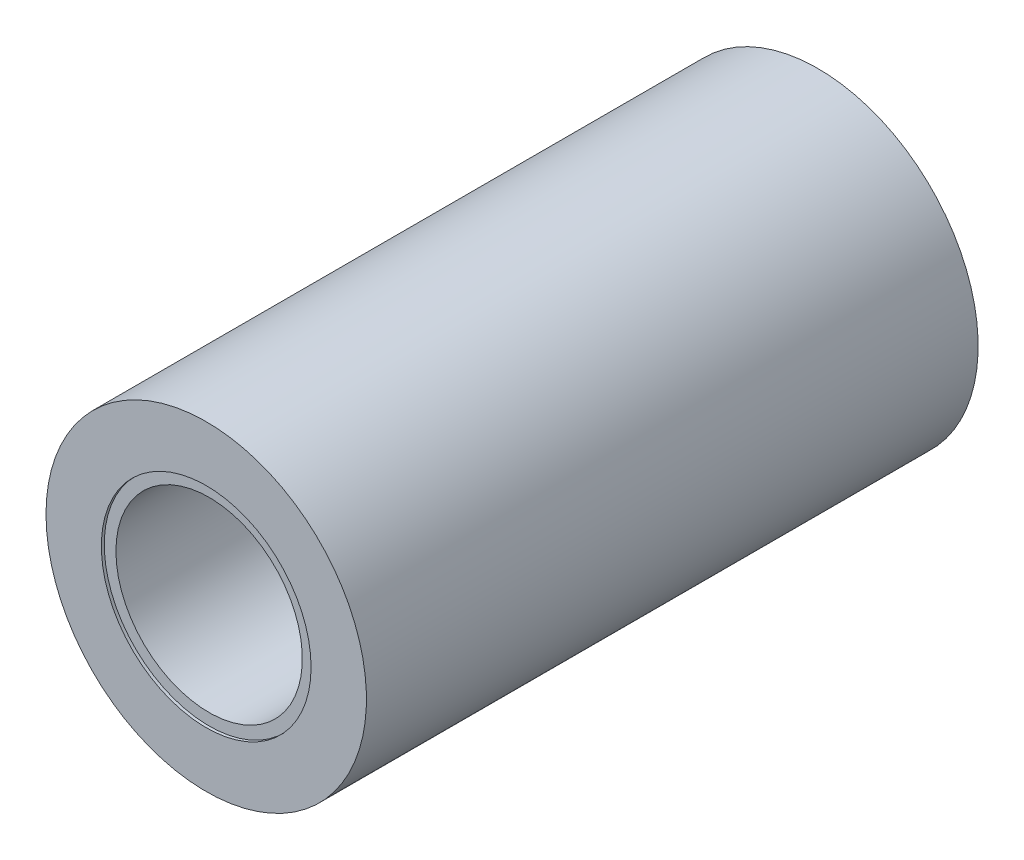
ISO-10303-21;
HEADER;
FILE_DESCRIPTION(('STEP AP214'),'2;1');
FILE_NAME('part.step','',(''),(''),'','','');
FILE_SCHEMA(('AUTOMOTIVE_DESIGN { 1 0 10303 214 1 1 1 1 }'));
ENDSEC;
DATA;
#1=APPLICATION_CONTEXT('core data for automotive mechanical design processes');
#2=APPLICATION_PROTOCOL_DEFINITION('international standard','automotive_design',2000,#1);
#3=PRODUCT_CONTEXT('',#1,'mechanical');
#4=PRODUCT('Part','Part','',(#3));
#5=PRODUCT_RELATED_PRODUCT_CATEGORY('part','',(#4));
#6=PRODUCT_DEFINITION_FORMATION('','',#4);
#7=PRODUCT_DEFINITION_CONTEXT('part definition',#1,'design');
#8=PRODUCT_DEFINITION('design','',#6,#7);
#9=PRODUCT_DEFINITION_SHAPE('','',#8);
#10=(LENGTH_UNIT() NAMED_UNIT(*) SI_UNIT(.MILLI.,.METRE.));
#11=(NAMED_UNIT(*) PLANE_ANGLE_UNIT() SI_UNIT($,.RADIAN.));
#12=(NAMED_UNIT(*) SI_UNIT($,.STERADIAN.) SOLID_ANGLE_UNIT());
#13=UNCERTAINTY_MEASURE_WITH_UNIT(LENGTH_MEASURE(1.E-05),#10,'distance_accuracy_value','');
#14=(GEOMETRIC_REPRESENTATION_CONTEXT(3) GLOBAL_UNCERTAINTY_ASSIGNED_CONTEXT((#13)) GLOBAL_UNIT_ASSIGNED_CONTEXT((#10,
#11,#12)) REPRESENTATION_CONTEXT('',''));
#15=CARTESIAN_POINT('',(0.,0.,0.));
#16=DIRECTION('',(0.,0.,1.));
#17=DIRECTION('',(1.,0.,0.));
#18=AXIS2_PLACEMENT_3D('',#15,#16,#17);
#19=CARTESIAN_POINT('',(0.,0.,10.5));
#20=DIRECTION('',(0.,0.,-1.));
#21=DIRECTION('',(-1.,0.,0.));
#22=AXIS2_PLACEMENT_3D('',#19,#20,#21);
#23=CYLINDRICAL_SURFACE('',#22,3.2);
#24=CARTESIAN_POINT('',(0.,0.,10.4));
#25=DIRECTION('',(0.,0.,1.));
#26=DIRECTION('',(1.,0.,0.));
#27=AXIS2_PLACEMENT_3D('',#24,#25,#26);
#28=CIRCLE('',#27,3.2);
#29=CARTESIAN_POINT('',(-3.2,0.,10.4));
#30=VERTEX_POINT('',#29);
#31=EDGE_CURVE('E47',#30,#30,#28,.T.);
#32=CARTESIAN_POINT('',(0.,0.,-10.4));
#33=DIRECTION('',(0.,0.,-1.));
#34=DIRECTION('',(-1.,0.,0.));
#35=AXIS2_PLACEMENT_3D('',#32,#33,#34);
#36=CIRCLE('',#35,3.2);
#37=CARTESIAN_POINT('',(-3.2,0.,-10.4));
#38=VERTEX_POINT('',#37);
#39=EDGE_CURVE('E38',#38,#38,#36,.T.);
#40=CARTESIAN_POINT('',(-3.2,0.,10.4));
#41=CARTESIAN_POINT('',(-3.2,0.,10.1833333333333));
#42=CARTESIAN_POINT('',(-3.2,0.,9.96666666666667));
#43=CARTESIAN_POINT('',(-3.2,0.,9.53333333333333));
#44=CARTESIAN_POINT('',(-3.2,0.,9.31666666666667));
#45=CARTESIAN_POINT('',(-3.2,0.,8.88333333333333));
#46=CARTESIAN_POINT('',(-3.2,0.,8.66666666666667));
#47=CARTESIAN_POINT('',(-3.2,0.,8.23333333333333));
#48=CARTESIAN_POINT('',(-3.2,0.,8.01666666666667));
#49=CARTESIAN_POINT('',(-3.2,0.,7.58333333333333));
#50=CARTESIAN_POINT('',(-3.2,0.,7.36666666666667));
#51=CARTESIAN_POINT('',(-3.2,0.,6.93333333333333));
#52=CARTESIAN_POINT('',(-3.2,0.,6.71666666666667));
#53=CARTESIAN_POINT('',(-3.2,0.,6.28333333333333));
#54=CARTESIAN_POINT('',(-3.2,0.,6.06666666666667));
#55=CARTESIAN_POINT('',(-3.2,0.,5.63333333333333));
#56=CARTESIAN_POINT('',(-3.2,0.,5.41666666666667));
#57=CARTESIAN_POINT('',(-3.2,0.,4.98333333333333));
#58=CARTESIAN_POINT('',(-3.2,0.,4.76666666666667));
#59=CARTESIAN_POINT('',(-3.2,0.,4.33333333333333));
#60=CARTESIAN_POINT('',(-3.2,0.,4.11666666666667));
#61=CARTESIAN_POINT('',(-3.2,0.,3.68333333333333));
#62=CARTESIAN_POINT('',(-3.2,0.,3.46666666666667));
#63=CARTESIAN_POINT('',(-3.2,0.,3.03333333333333));
#64=CARTESIAN_POINT('',(-3.2,0.,2.81666666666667));
#65=CARTESIAN_POINT('',(-3.2,0.,2.38333333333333));
#66=CARTESIAN_POINT('',(-3.2,0.,2.16666666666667));
#67=CARTESIAN_POINT('',(-3.2,0.,1.73333333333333));
#68=CARTESIAN_POINT('',(-3.2,0.,1.51666666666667));
#69=CARTESIAN_POINT('',(-3.2,0.,1.08333333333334));
#70=CARTESIAN_POINT('',(-3.2,0.,0.866666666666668));
#71=CARTESIAN_POINT('',(-3.2,0.,0.433333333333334));
#72=CARTESIAN_POINT('',(-3.2,0.,0.216666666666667));
#73=CARTESIAN_POINT('',(-3.2,0.,-0.216666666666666));
#74=CARTESIAN_POINT('',(-3.2,0.,-0.433333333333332));
#75=CARTESIAN_POINT('',(-3.2,0.,-0.866666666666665));
#76=CARTESIAN_POINT('',(-3.2,0.,-1.08333333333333));
#77=CARTESIAN_POINT('',(-3.2,0.,-1.51666666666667));
#78=CARTESIAN_POINT('',(-3.2,0.,-1.73333333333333));
#79=CARTESIAN_POINT('',(-3.2,0.,-2.16666666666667));
#80=CARTESIAN_POINT('',(-3.2,0.,-2.38333333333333));
#81=CARTESIAN_POINT('',(-3.2,0.,-2.81666666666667));
#82=CARTESIAN_POINT('',(-3.2,0.,-3.03333333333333));
#83=CARTESIAN_POINT('',(-3.2,0.,-3.46666666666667));
#84=CARTESIAN_POINT('',(-3.2,0.,-3.68333333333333));
#85=CARTESIAN_POINT('',(-3.2,0.,-4.11666666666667));
#86=CARTESIAN_POINT('',(-3.2,0.,-4.33333333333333));
#87=CARTESIAN_POINT('',(-3.2,0.,-4.76666666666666));
#88=CARTESIAN_POINT('',(-3.2,0.,-4.98333333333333));
#89=CARTESIAN_POINT('',(-3.2,0.,-5.41666666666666));
#90=CARTESIAN_POINT('',(-3.2,0.,-5.63333333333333));
#91=CARTESIAN_POINT('',(-3.2,0.,-6.06666666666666));
#92=CARTESIAN_POINT('',(-3.2,0.,-6.28333333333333));
#93=CARTESIAN_POINT('',(-3.2,0.,-6.71666666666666));
#94=CARTESIAN_POINT('',(-3.2,0.,-6.93333333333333));
#95=CARTESIAN_POINT('',(-3.2,0.,-7.36666666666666));
#96=CARTESIAN_POINT('',(-3.2,0.,-7.58333333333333));
#97=CARTESIAN_POINT('',(-3.2,0.,-8.01666666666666));
#98=CARTESIAN_POINT('',(-3.2,0.,-8.23333333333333));
#99=CARTESIAN_POINT('',(-3.2,0.,-8.66666666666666));
#100=CARTESIAN_POINT('',(-3.2,0.,-8.88333333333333));
#101=CARTESIAN_POINT('',(-3.2,0.,-9.31666666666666));
#102=CARTESIAN_POINT('',(-3.2,0.,-9.53333333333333));
#103=CARTESIAN_POINT('',(-3.2,0.,-9.96666666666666));
#104=CARTESIAN_POINT('',(-3.2,0.,-10.1833333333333));
#105=CARTESIAN_POINT('',(-3.2,0.,-10.4));
#106=B_SPLINE_CURVE_WITH_KNOTS('',3,(#40,#41,#42,#43,#44,#45,#46,#47,#48,#49,#50,#51,#52,#53,
#54,#55,#56,#57,#58,#59,#60,#61,#62,#63,#64,#65,#66,#67,#68,#69,#70,#71,#72,#73,#74,#75,#76,#77,
#78,#79,#80,#81,#82,#83,#84,#85,#86,#87,#88,#89,#90,#91,#92,#93,#94,#95,#96,#97,#98,#99,#100,
#101,#102,#103,#104,#105),.UNSPECIFIED.,.F.,.F.,(4,2,2,2,2,2,2,2,2,2,2,2,2,2,2,2,2,2,2,2,2,2,2,
2,2,2,2,2,2,2,2,2,4),(0.,0.650000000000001,1.3,1.95,2.6,3.25,3.9,4.55,5.2,5.85,6.5,7.15,7.8,
8.45,9.1,9.75,10.4,11.05,11.7,12.35,13.,13.65,14.3,14.95,15.6,16.25,16.9,17.55,18.2,18.85,19.5,
20.15,20.8),.UNSPECIFIED.);
#107=EDGE_CURVE('BSEAM34',#30,#38,#106,.T.);
#108=ORIENTED_EDGE('',*,*,#31,.T.);
#109=ORIENTED_EDGE('',*,*,#39,.T.);
#110=ORIENTED_EDGE('',*,*,#107,.T.);
#111=ORIENTED_EDGE('',*,*,#107,.F.);
#112=EDGE_LOOP('',(#108,#110,#109,#111));
#113=FACE_BOUND('',#112,.T.);
#114=ADVANCED_FACE('F34',(#113),#23,.F.);
#115=CARTESIAN_POINT('',(0.,0.,10.5));
#116=DIRECTION('',(0.,0.,1.));
#117=DIRECTION('',(1.,0.,0.));
#118=AXIS2_PLACEMENT_3D('',#115,#116,#117);
#119=PLANE('',#118);
#120=CARTESIAN_POINT('',(0.,0.,10.5));
#121=DIRECTION('',(0.,0.,1.));
#122=DIRECTION('',(1.,0.,0.));
#123=AXIS2_PLACEMENT_3D('',#120,#121,#122);
#124=CIRCLE('',#123,3.6);
#125=CARTESIAN_POINT('',(3.6,0.,10.5));
#126=VERTEX_POINT('',#125);
#127=EDGE_CURVE('E50',#126,#126,#124,.T.);
#128=ORIENTED_EDGE('',*,*,#127,.F.);
#129=EDGE_LOOP('',(#128));
#130=FACE_BOUND('',#129,.T.);
#131=CARTESIAN_POINT('',(0.,0.,10.5));
#132=DIRECTION('',(0.,0.,1.));
#133=DIRECTION('',(1.,0.,0.));
#134=AXIS2_PLACEMENT_3D('',#131,#132,#133);
#135=CIRCLE('',#134,5.5);
#136=CARTESIAN_POINT('',(-5.5,0.,10.5));
#137=VERTEX_POINT('',#136);
#138=EDGE_CURVE('E10',#137,#137,#135,.T.);
#139=ORIENTED_EDGE('',*,*,#138,.T.);
#140=EDGE_LOOP('',(#139));
#141=FACE_BOUND('',#140,.T.);
#142=ADVANCED_FACE('F83',(#130,#141),#119,.T.);
#143=CARTESIAN_POINT('',(0.,0.,-10.5));
#144=DIRECTION('',(0.,0.,1.));
#145=DIRECTION('',(1.,0.,0.));
#146=AXIS2_PLACEMENT_3D('',#143,#144,#145);
#147=PLANE('',#146);
#148=CARTESIAN_POINT('',(0.,0.,-10.5));
#149=DIRECTION('',(0.,0.,-1.));
#150=DIRECTION('',(-1.,0.,0.));
#151=AXIS2_PLACEMENT_3D('',#148,#149,#150);
#152=CIRCLE('',#151,3.6);
#153=CARTESIAN_POINT('',(-3.6,0.,-10.5));
#154=VERTEX_POINT('',#153);
#155=EDGE_CURVE('E61',#154,#154,#152,.T.);
#156=ORIENTED_EDGE('',*,*,#155,.F.);
#157=EDGE_LOOP('',(#156));
#158=FACE_BOUND('',#157,.T.);
#159=CARTESIAN_POINT('',(0.,0.,-10.5));
#160=DIRECTION('',(0.,0.,1.));
#161=DIRECTION('',(1.,0.,0.));
#162=AXIS2_PLACEMENT_3D('',#159,#160,#161);
#163=CIRCLE('',#162,5.5);
#164=CARTESIAN_POINT('',(-5.5,0.,-10.5));
#165=VERTEX_POINT('',#164);
#166=EDGE_CURVE('E42',#165,#165,#163,.T.);
#167=ORIENTED_EDGE('',*,*,#166,.F.);
#168=EDGE_LOOP('',(#167));
#169=FACE_BOUND('',#168,.T.);
#170=ADVANCED_FACE('F88',(#158,#169),#147,.F.);
#171=CARTESIAN_POINT('',(0.,0.,10.5));
#172=DIRECTION('',(0.,0.,-1.));
#173=DIRECTION('',(-1.,0.,0.));
#174=AXIS2_PLACEMENT_3D('',#171,#172,#173);
#175=CYLINDRICAL_SURFACE('',#174,5.5);
#176=CARTESIAN_POINT('',(-5.5,0.,10.5));
#177=CARTESIAN_POINT('',(-5.5,0.,10.28125));
#178=CARTESIAN_POINT('',(-5.5,0.,10.0625));
#179=CARTESIAN_POINT('',(-5.5,0.,9.625));
#180=CARTESIAN_POINT('',(-5.5,0.,9.40625));
#181=CARTESIAN_POINT('',(-5.5,0.,8.96875));
#182=CARTESIAN_POINT('',(-5.5,0.,8.75));
#183=CARTESIAN_POINT('',(-5.5,0.,8.3125));
#184=CARTESIAN_POINT('',(-5.5,0.,8.09375));
#185=CARTESIAN_POINT('',(-5.5,0.,7.65625));
#186=CARTESIAN_POINT('',(-5.5,0.,7.4375));
#187=CARTESIAN_POINT('',(-5.5,0.,7.));
#188=CARTESIAN_POINT('',(-5.5,0.,6.78125));
#189=CARTESIAN_POINT('',(-5.5,0.,6.34375));
#190=CARTESIAN_POINT('',(-5.5,0.,6.125));
#191=CARTESIAN_POINT('',(-5.5,0.,5.6875));
#192=CARTESIAN_POINT('',(-5.5,0.,5.46875));
#193=CARTESIAN_POINT('',(-5.5,0.,5.03125));
#194=CARTESIAN_POINT('',(-5.5,0.,4.8125));
#195=CARTESIAN_POINT('',(-5.5,0.,4.375));
#196=CARTESIAN_POINT('',(-5.5,0.,4.15625));
#197=CARTESIAN_POINT('',(-5.5,0.,3.71875));
#198=CARTESIAN_POINT('',(-5.5,0.,3.5));
#199=CARTESIAN_POINT('',(-5.5,0.,3.0625));
#200=CARTESIAN_POINT('',(-5.5,0.,2.84375));
#201=CARTESIAN_POINT('',(-5.5,0.,2.40625));
#202=CARTESIAN_POINT('',(-5.5,0.,2.1875));
#203=CARTESIAN_POINT('',(-5.5,0.,1.75));
#204=CARTESIAN_POINT('',(-5.5,0.,1.53125));
#205=CARTESIAN_POINT('',(-5.5,0.,1.09375));
#206=CARTESIAN_POINT('',(-5.5,0.,0.875000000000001));
#207=CARTESIAN_POINT('',(-5.5,0.,0.4375));
#208=CARTESIAN_POINT('',(-5.5,0.,0.21875));
#209=CARTESIAN_POINT('',(-5.5,0.,-0.21875));
#210=CARTESIAN_POINT('',(-5.5,0.,-0.4375));
#211=CARTESIAN_POINT('',(-5.5,0.,-0.875000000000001));
#212=CARTESIAN_POINT('',(-5.5,0.,-1.09375));
#213=CARTESIAN_POINT('',(-5.5,0.,-1.53125));
#214=CARTESIAN_POINT('',(-5.5,0.,-1.75));
#215=CARTESIAN_POINT('',(-5.5,0.,-2.1875));
#216=CARTESIAN_POINT('',(-5.5,0.,-2.40625));
#217=CARTESIAN_POINT('',(-5.5,0.,-2.84375));
#218=CARTESIAN_POINT('',(-5.5,0.,-3.0625));
#219=CARTESIAN_POINT('',(-5.5,0.,-3.5));
#220=CARTESIAN_POINT('',(-5.5,0.,-3.71875));
#221=CARTESIAN_POINT('',(-5.5,0.,-4.15625));
#222=CARTESIAN_POINT('',(-5.5,0.,-4.375));
#223=CARTESIAN_POINT('',(-5.5,0.,-4.8125));
#224=CARTESIAN_POINT('',(-5.5,0.,-5.03125));
#225=CARTESIAN_POINT('',(-5.5,0.,-5.46875));
#226=CARTESIAN_POINT('',(-5.5,0.,-5.6875));
#227=CARTESIAN_POINT('',(-5.5,0.,-6.125));
#228=CARTESIAN_POINT('',(-5.5,0.,-6.34375));
#229=CARTESIAN_POINT('',(-5.5,0.,-6.78125));
#230=CARTESIAN_POINT('',(-5.5,0.,-7.));
#231=CARTESIAN_POINT('',(-5.5,0.,-7.4375));
#232=CARTESIAN_POINT('',(-5.5,0.,-7.65625));
#233=CARTESIAN_POINT('',(-5.5,0.,-8.09375));
#234=CARTESIAN_POINT('',(-5.5,0.,-8.3125));
#235=CARTESIAN_POINT('',(-5.5,0.,-8.75));
#236=CARTESIAN_POINT('',(-5.5,0.,-8.96875));
#237=CARTESIAN_POINT('',(-5.5,0.,-9.40625));
#238=CARTESIAN_POINT('',(-5.5,0.,-9.625));
#239=CARTESIAN_POINT('',(-5.5,0.,-10.0625));
#240=CARTESIAN_POINT('',(-5.5,0.,-10.28125));
#241=CARTESIAN_POINT('',(-5.5,0.,-10.5));
#242=B_SPLINE_CURVE_WITH_KNOTS('',3,(#176,#177,#178,#179,#180,#181,#182,#183,#184,#185,#186,
#187,#188,#189,#190,#191,#192,#193,#194,#195,#196,#197,#198,#199,#200,#201,#202,#203,#204,#205,
#206,#207,#208,#209,#210,#211,#212,#213,#214,#215,#216,#217,#218,#219,#220,#221,#222,#223,#224,
#225,#226,#227,#228,#229,#230,#231,#232,#233,#234,#235,#236,#237,#238,#239,#240,#241),
.UNSPECIFIED.,.F.,.F.,(4,2,2,2,2,2,2,2,2,2,2,2,2,2,2,2,2,2,2,2,2,2,2,2,2,2,2,2,2,2,2,2,4),(0.,
0.656250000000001,1.3125,1.96875,2.625,3.28125,3.9375,4.59375,5.25,5.90625,6.5625,7.21875,7.875,
8.53125,9.1875,9.84375,10.5,11.15625,11.8125,12.46875,13.125,13.78125,14.4375,15.09375,15.75,
16.40625,17.0625,17.71875,18.375,19.03125,19.6875,20.34375,21.),.UNSPECIFIED.);
#243=EDGE_CURVE('BSEAM36',#137,#165,#242,.T.);
#244=ORIENTED_EDGE('',*,*,#138,.F.);
#245=ORIENTED_EDGE('',*,*,#166,.T.);
#246=ORIENTED_EDGE('',*,*,#243,.T.);
#247=ORIENTED_EDGE('',*,*,#243,.F.);
#248=EDGE_LOOP('',(#244,#246,#245,#247));
#249=FACE_BOUND('',#248,.T.);
#250=ADVANCED_FACE('F36',(#249),#175,.T.);
#251=CARTESIAN_POINT('',(0.,0.,10.4));
#252=DIRECTION('',(0.,0.,1.));
#253=DIRECTION('',(1.,0.,0.));
#254=AXIS2_PLACEMENT_3D('',#251,#252,#253);
#255=CYLINDRICAL_SURFACE('',#254,3.6);
#256=CARTESIAN_POINT('',(0.,0.,10.4));
#257=DIRECTION('',(0.,0.,1.));
#258=DIRECTION('',(1.,0.,0.));
#259=AXIS2_PLACEMENT_3D('',#256,#257,#258);
#260=CIRCLE('',#259,3.6);
#261=CARTESIAN_POINT('',(3.6,0.,10.4));
#262=VERTEX_POINT('',#261);
#263=EDGE_CURVE('E53',#262,#262,#260,.T.);
#264=ORIENTED_EDGE('',*,*,#263,.F.);
#265=EDGE_LOOP('',(#264));
#266=FACE_BOUND('',#265,.T.);
#267=ORIENTED_EDGE('',*,*,#127,.T.);
#268=EDGE_LOOP('',(#267));
#269=FACE_BOUND('',#268,.T.);
#270=ADVANCED_FACE('F92',(#266,#269),#255,.F.);
#271=CARTESIAN_POINT('',(0.,0.,10.4));
#272=DIRECTION('',(0.,0.,1.));
#273=DIRECTION('',(1.,0.,0.));
#274=AXIS2_PLACEMENT_3D('',#271,#272,#273);
#275=PLANE('',#274);
#276=ORIENTED_EDGE('',*,*,#31,.F.);
#277=EDGE_LOOP('',(#276));
#278=FACE_BOUND('',#277,.T.);
#279=ORIENTED_EDGE('',*,*,#263,.T.);
#280=EDGE_LOOP('',(#279));
#281=FACE_BOUND('',#280,.T.);
#282=ADVANCED_FACE('F79',(#278,#281),#275,.T.);
#283=CARTESIAN_POINT('',(0.,0.,-10.4));
#284=DIRECTION('',(0.,0.,-1.));
#285=DIRECTION('',(-1.,0.,0.));
#286=AXIS2_PLACEMENT_3D('',#283,#284,#285);
#287=CYLINDRICAL_SURFACE('',#286,3.6);
#288=CARTESIAN_POINT('',(0.,0.,-10.4));
#289=DIRECTION('',(0.,0.,-1.));
#290=DIRECTION('',(-1.,0.,0.));
#291=AXIS2_PLACEMENT_3D('',#288,#289,#290);
#292=CIRCLE('',#291,3.6);
#293=CARTESIAN_POINT('',(-3.6,0.,-10.4));
#294=VERTEX_POINT('',#293);
#295=EDGE_CURVE('E64',#294,#294,#292,.T.);
#296=ORIENTED_EDGE('',*,*,#295,.F.);
#297=EDGE_LOOP('',(#296));
#298=FACE_BOUND('',#297,.T.);
#299=ORIENTED_EDGE('',*,*,#155,.T.);
#300=EDGE_LOOP('',(#299));
#301=FACE_BOUND('',#300,.T.);
#302=ADVANCED_FACE('F74',(#298,#301),#287,.F.);
#303=CARTESIAN_POINT('',(0.,0.,-10.4));
#304=DIRECTION('',(0.,0.,-1.));
#305=DIRECTION('',(-1.,0.,0.));
#306=AXIS2_PLACEMENT_3D('',#303,#304,#305);
#307=PLANE('',#306);
#308=ORIENTED_EDGE('',*,*,#39,.F.);
#309=EDGE_LOOP('',(#308));
#310=FACE_BOUND('',#309,.T.);
#311=ORIENTED_EDGE('',*,*,#295,.T.);
#312=EDGE_LOOP('',(#311));
#313=FACE_BOUND('',#312,.T.);
#314=ADVANCED_FACE('F72',(#310,#313),#307,.T.);
#315=CLOSED_SHELL('',(#114,#142,#170,#250,#270,#282,#302,#314));
#316=MANIFOLD_SOLID_BREP('B2',#315);
#317=ADVANCED_BREP_SHAPE_REPRESENTATION('',(#18,#316),#14);
#318=SHAPE_DEFINITION_REPRESENTATION(#9,#317);
ENDSEC;
END-ISO-10303-21;
